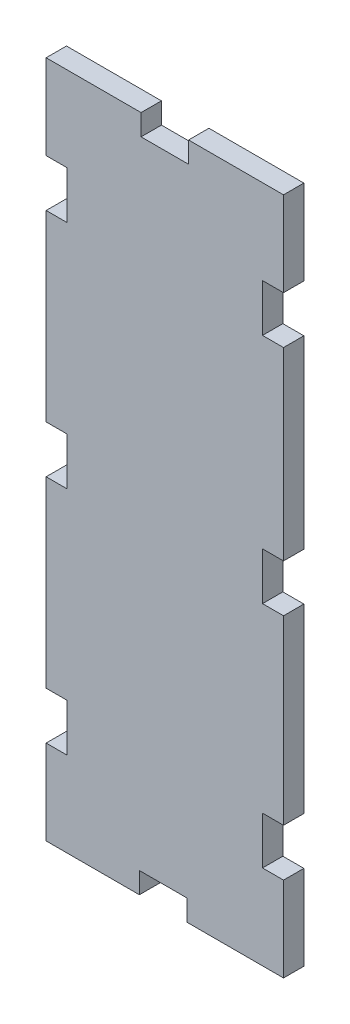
from build123d import *

# Parameters (mm, degrees)
SKETCH1_W           = 70
SKETCH1_H           = 200
BOSS_EXTRUDE2_DEPTH = 6
SKETCH4_W           = 14
SKETCH4_H           = 6.2
SKETCH4_W_2         = 6.2
SKETCH4_H_2         = 14
CUT_EXTRUDE1_DEPTH  = 6


with BuildPart() as part:
    # Sketch1 → Boss-Extrude2 (new body)
    with BuildSketch(Plane.XY):
        with Locations((35, 100)):
            Rectangle(SKETCH1_W, SKETCH1_H)
    extrude(amount=BOSS_EXTRUDE2_DEPTH)

    # Sketch4 → Cut-Extrude1 (cut)
    with BuildSketch(Plane.XY.offset(6)):
        with Locations((35, 196.9)):
            Rectangle(SKETCH4_W, SKETCH4_H)
        with Locations((34.5, 3.1)):
            Rectangle(SKETCH4_W, SKETCH4_H)
        with Locations((3.1, 168)):
            Rectangle(SKETCH4_W_2, SKETCH4_H_2)
        with Locations((3.1, 100)):
            Rectangle(SKETCH4_W_2, SKETCH4_H_2)
        with Locations((3.1, 32)):
            Rectangle(SKETCH4_W_2, SKETCH4_H_2)
        with Locations((66.9, 168)):
            Rectangle(SKETCH4_W_2, SKETCH4_H_2)
        with Locations((66.9, 99.5)):
            Rectangle(SKETCH4_W_2, SKETCH4_H_2)
        with Locations((66.9, 32)):
            Rectangle(SKETCH4_W_2, SKETCH4_H_2)
    extrude(amount=-CUT_EXTRUDE1_DEPTH, mode=Mode.SUBTRACT)


solid = part.part
